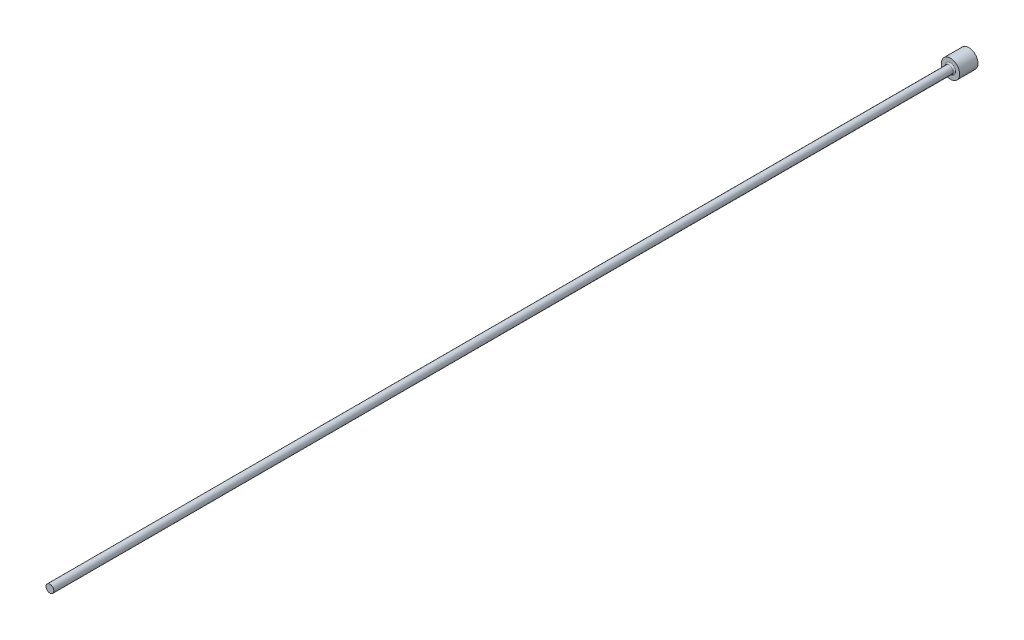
ISO-10303-21;
HEADER;
FILE_DESCRIPTION(('STEP AP214'),'2;1');
FILE_NAME('part.step','',(''),(''),'','','');
FILE_SCHEMA(('AUTOMOTIVE_DESIGN { 1 0 10303 214 1 1 1 1 }'));
ENDSEC;
DATA;
#1=APPLICATION_CONTEXT('core data for automotive mechanical design processes');
#2=APPLICATION_PROTOCOL_DEFINITION('international standard','automotive_design',2000,#1);
#3=PRODUCT_CONTEXT('',#1,'mechanical');
#4=PRODUCT('Part','Part','',(#3));
#5=PRODUCT_RELATED_PRODUCT_CATEGORY('part','',(#4));
#6=PRODUCT_DEFINITION_FORMATION('','',#4);
#7=PRODUCT_DEFINITION_CONTEXT('part definition',#1,'design');
#8=PRODUCT_DEFINITION('design','',#6,#7);
#9=PRODUCT_DEFINITION_SHAPE('','',#8);
#10=(LENGTH_UNIT() NAMED_UNIT(*) SI_UNIT(.MILLI.,.METRE.));
#11=(NAMED_UNIT(*) PLANE_ANGLE_UNIT() SI_UNIT($,.RADIAN.));
#12=(NAMED_UNIT(*) SI_UNIT($,.STERADIAN.) SOLID_ANGLE_UNIT());
#13=UNCERTAINTY_MEASURE_WITH_UNIT(LENGTH_MEASURE(1.E-05),#10,'distance_accuracy_value','');
#14=(GEOMETRIC_REPRESENTATION_CONTEXT(3) GLOBAL_UNCERTAINTY_ASSIGNED_CONTEXT((#13)) GLOBAL_UNIT_ASSIGNED_CONTEXT((#10,
#11,#12)) REPRESENTATION_CONTEXT('',''));
#15=CARTESIAN_POINT('',(0.,0.,0.));
#16=DIRECTION('',(0.,0.,1.));
#17=DIRECTION('',(1.,0.,0.));
#18=AXIS2_PLACEMENT_3D('',#15,#16,#17);
#19=CARTESIAN_POINT('',(2.,0.,4.));
#20=DIRECTION('',(0.,0.,-1.));
#21=DIRECTION('',(-1.,0.,0.));
#22=AXIS2_PLACEMENT_3D('',#19,#20,#21);
#23=PLANE('',#22);
#24=CARTESIAN_POINT('',(0.,0.,4.));
#25=DIRECTION('',(0.,0.,-1.));
#26=DIRECTION('',(-1.,0.,0.));
#27=AXIS2_PLACEMENT_3D('',#24,#25,#26);
#28=CIRCLE('',#27,1.15000000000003);
#29=CARTESIAN_POINT('',(-1.15000000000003,0.,4.));
#30=VERTEX_POINT('',#29);
#31=EDGE_CURVE('E40',#30,#30,#28,.T.);
#32=ORIENTED_EDGE('',*,*,#31,.T.);
#33=EDGE_LOOP('',(#32));
#34=FACE_BOUND('',#33,.T.);
#35=CARTESIAN_POINT('',(0.,0.,4.));
#36=DIRECTION('',(0.,0.,-1.));
#37=DIRECTION('',(-1.,0.,0.));
#38=AXIS2_PLACEMENT_3D('',#35,#36,#37);
#39=CIRCLE('',#38,2.);
#40=CARTESIAN_POINT('',(-2.,0.,4.));
#41=VERTEX_POINT('',#40);
#42=EDGE_CURVE('E44',#41,#41,#39,.T.);
#43=ORIENTED_EDGE('',*,*,#42,.F.);
#44=EDGE_LOOP('',(#43));
#45=FACE_BOUND('',#44,.T.);
#46=ADVANCED_FACE('F33',(#34,#45),#23,.F.);
#47=CARTESIAN_POINT('',(0.,0.,-9.03322817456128));
#48=DIRECTION('',(0.,0.,-1.));
#49=DIRECTION('',(-1.,0.,0.));
#50=AXIS2_PLACEMENT_3D('',#47,#48,#49);
#51=CYLINDRICAL_SURFACE('',#50,2.);
#52=CARTESIAN_POINT('',(0.,0.,0.));
#53=DIRECTION('',(0.,0.,-1.));
#54=DIRECTION('',(-1.,0.,0.));
#55=AXIS2_PLACEMENT_3D('',#52,#53,#54);
#56=CIRCLE('',#55,2.);
#57=CARTESIAN_POINT('',(-2.,0.,0.));
#58=VERTEX_POINT('',#57);
#59=EDGE_CURVE('E48',#58,#58,#56,.T.);
#60=ORIENTED_EDGE('',*,*,#59,.F.);
#61=EDGE_LOOP('',(#60));
#62=FACE_BOUND('',#61,.T.);
#63=ORIENTED_EDGE('',*,*,#42,.T.);
#64=EDGE_LOOP('',(#63));
#65=FACE_BOUND('',#64,.T.);
#66=ADVANCED_FACE('F68',(#62,#65),#51,.T.);
#67=CARTESIAN_POINT('',(0.,0.,0.));
#68=DIRECTION('',(0.,0.,1.));
#69=DIRECTION('',(1.,0.,0.));
#70=AXIS2_PLACEMENT_3D('',#67,#68,#69);
#71=PLANE('',#70);
#72=ORIENTED_EDGE('',*,*,#59,.T.);
#73=EDGE_LOOP('',(#72));
#74=FACE_BOUND('',#73,.T.);
#75=ADVANCED_FACE('F61',(#74),#71,.F.);
#76=CARTESIAN_POINT('',(0.,0.,200.));
#77=DIRECTION('',(0.,0.,-1.));
#78=DIRECTION('',(-1.,0.,0.));
#79=AXIS2_PLACEMENT_3D('',#76,#77,#78);
#80=PLANE('',#79);
#81=CARTESIAN_POINT('',(0.,0.,200.));
#82=DIRECTION('',(0.,0.,-1.));
#83=DIRECTION('',(-1.,0.,0.));
#84=AXIS2_PLACEMENT_3D('',#81,#82,#83);
#85=CIRCLE('',#84,0.850000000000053);
#86=CARTESIAN_POINT('',(-0.850000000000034,0.,200.));
#87=VERTEX_POINT('',#86);
#88=EDGE_CURVE('E53',#87,#87,#85,.T.);
#89=ORIENTED_EDGE('',*,*,#88,.F.);
#90=EDGE_LOOP('',(#89));
#91=FACE_BOUND('',#90,.T.);
#92=ADVANCED_FACE('F59',(#91),#80,.F.);
#93=CARTESIAN_POINT('',(0.,0.,-9.03322817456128));
#94=DIRECTION('',(0.,0.,-1.));
#95=DIRECTION('',(-1.,0.,0.));
#96=AXIS2_PLACEMENT_3D('',#93,#94,#95);
#97=CYLINDRICAL_SURFACE('',#96,0.850000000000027);
#98=CARTESIAN_POINT('',(0.,0.,4.3));
#99=DIRECTION('',(0.,0.,-1.));
#100=DIRECTION('',(-1.,0.,0.));
#101=AXIS2_PLACEMENT_3D('',#98,#99,#100);
#102=CIRCLE('',#101,0.850000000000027);
#103=CARTESIAN_POINT('',(-0.850000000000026,0.,4.3));
#104=VERTEX_POINT('',#103);
#105=EDGE_CURVE('E10',#104,#104,#102,.F.);
#106=ORIENTED_EDGE('',*,*,#105,.T.);
#107=EDGE_LOOP('',(#106));
#108=FACE_BOUND('',#107,.T.);
#109=ORIENTED_EDGE('',*,*,#88,.T.);
#110=EDGE_LOOP('',(#109));
#111=FACE_BOUND('',#110,.T.);
#112=ADVANCED_FACE('F57',(#108,#111),#97,.T.);
#113=CARTESIAN_POINT('',(0.,0.,4.3));
#114=DIRECTION('',(0.,0.,-1.));
#115=DIRECTION('',(-1.,0.,0.));
#116=AXIS2_PLACEMENT_3D('',#113,#114,#115);
#117=TOROIDAL_SURFACE('',#116,1.15000000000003,0.3);
#118=ORIENTED_EDGE('',*,*,#105,.F.);
#119=EDGE_LOOP('',(#118));
#120=FACE_BOUND('',#119,.T.);
#121=ORIENTED_EDGE('',*,*,#31,.F.);
#122=EDGE_LOOP('',(#121));
#123=FACE_BOUND('',#122,.T.);
#124=ADVANCED_FACE('F35',(#120,#123),#117,.F.);
#125=CLOSED_SHELL('',(#46,#66,#75,#92,#112,#124));
#126=MANIFOLD_SOLID_BREP('B2',#125);
#127=ADVANCED_BREP_SHAPE_REPRESENTATION('',(#18,#126),#14);
#128=SHAPE_DEFINITION_REPRESENTATION(#9,#127);
ENDSEC;
END-ISO-10303-21;
